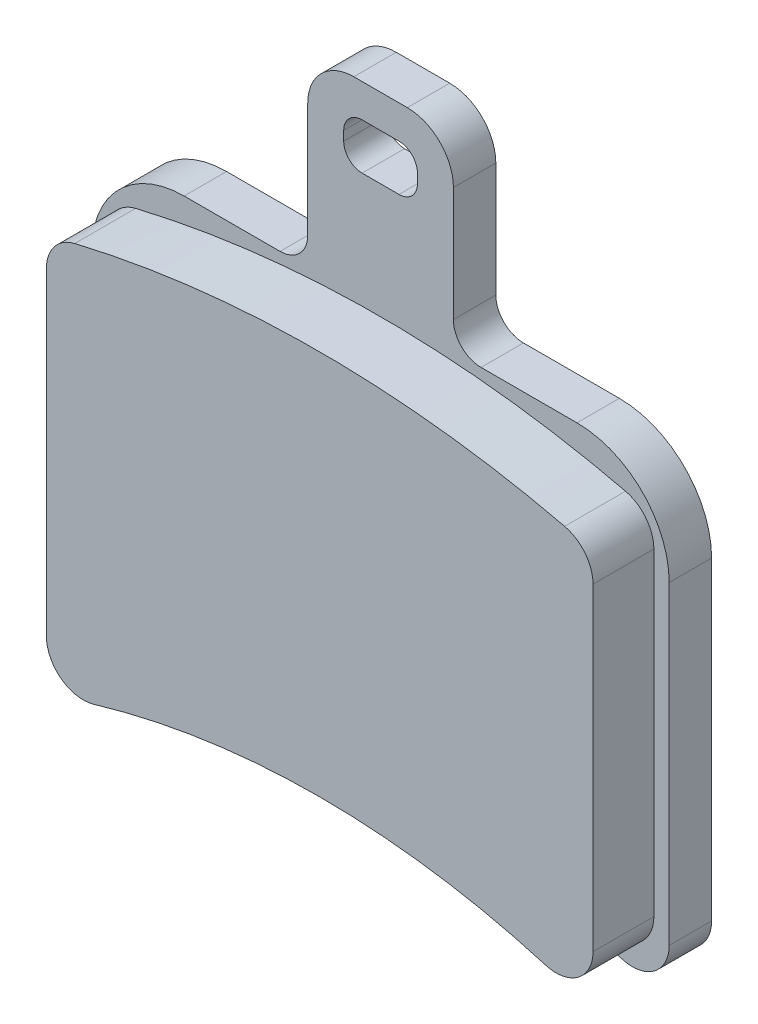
ISO-10303-21;
HEADER;
FILE_DESCRIPTION(('STEP AP214'),'2;1');
FILE_NAME('part.step','',(''),(''),'','','');
FILE_SCHEMA(('AUTOMOTIVE_DESIGN { 1 0 10303 214 1 1 1 1 }'));
ENDSEC;
DATA;
#1=APPLICATION_CONTEXT('core data for automotive mechanical design processes');
#2=APPLICATION_PROTOCOL_DEFINITION('international standard','automotive_design',2000,#1);
#3=PRODUCT_CONTEXT('',#1,'mechanical');
#4=PRODUCT('Part','Part','',(#3));
#5=PRODUCT_RELATED_PRODUCT_CATEGORY('part','',(#4));
#6=PRODUCT_DEFINITION_FORMATION('','',#4);
#7=PRODUCT_DEFINITION_CONTEXT('part definition',#1,'design');
#8=PRODUCT_DEFINITION('design','',#6,#7);
#9=PRODUCT_DEFINITION_SHAPE('','',#8);
#10=(LENGTH_UNIT() NAMED_UNIT(*) SI_UNIT(.MILLI.,.METRE.));
#11=(NAMED_UNIT(*) PLANE_ANGLE_UNIT() SI_UNIT($,.RADIAN.));
#12=(NAMED_UNIT(*) SI_UNIT($,.STERADIAN.) SOLID_ANGLE_UNIT());
#13=UNCERTAINTY_MEASURE_WITH_UNIT(LENGTH_MEASURE(1.E-05),#10,'distance_accuracy_value','');
#14=(GEOMETRIC_REPRESENTATION_CONTEXT(3) GLOBAL_UNCERTAINTY_ASSIGNED_CONTEXT((#13)) GLOBAL_UNIT_ASSIGNED_CONTEXT((#10,
#11,#12)) REPRESENTATION_CONTEXT('',''));
#15=CARTESIAN_POINT('',(0.,0.,0.));
#16=DIRECTION('',(0.,0.,1.));
#17=DIRECTION('',(1.,0.,0.));
#18=AXIS2_PLACEMENT_3D('',#15,#16,#17);
#19=CARTESIAN_POINT('',(16.2814,-4.44620415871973,4.191));
#20=DIRECTION('',(0.,0.,-1.));
#21=DIRECTION('',(-1.,0.,0.));
#22=AXIS2_PLACEMENT_3D('',#19,#20,#21);
#23=CYLINDRICAL_SURFACE('',#22,2.54);
#24=CARTESIAN_POINT('',(16.2814,-4.44620415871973,0.));
#25=DIRECTION('',(0.,0.,1.));
#26=DIRECTION('',(1.,0.,0.));
#27=AXIS2_PLACEMENT_3D('',#24,#25,#26);
#28=CIRCLE('',#27,2.54);
#29=CARTESIAN_POINT('',(18.8214,-4.44620415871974,0.));
#30=VERTEX_POINT('',#29);
#31=CARTESIAN_POINT('',(16.8681171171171,-1.9748962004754,0.));
#32=VERTEX_POINT('',#31);
#33=EDGE_CURVE('E400',#30,#32,#28,.T.);
#34=ORIENTED_EDGE('',*,*,#33,.T.);
#35=DIRECTION('',(0.,0.,-1.));
#36=VECTOR('',#35,1.);
#37=CARTESIAN_POINT('',(16.8681171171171,-1.97489620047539,4.19099999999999));
#38=LINE('',#37,#36);
#39=CARTESIAN_POINT('',(16.8681171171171,-1.97489620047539,4.19099999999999));
#40=VERTEX_POINT('',#39);
#41=EDGE_CURVE('E11',#40,#32,#38,.T.);
#42=ORIENTED_EDGE('',*,*,#41,.F.);
#43=CARTESIAN_POINT('',(16.2814,-4.44620415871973,4.191));
#44=DIRECTION('',(0.,0.,1.));
#45=DIRECTION('',(1.,0.,0.));
#46=AXIS2_PLACEMENT_3D('',#43,#44,#45);
#47=CIRCLE('',#46,2.54);
#48=CARTESIAN_POINT('',(18.8214,-4.44620415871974,4.19099999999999));
#49=VERTEX_POINT('',#48);
#50=EDGE_CURVE('E453',#49,#40,#47,.T.);
#51=ORIENTED_EDGE('',*,*,#50,.F.);
#52=DIRECTION('',(0.,0.,-1.));
#53=VECTOR('',#52,1.);
#54=CARTESIAN_POINT('',(18.8214,-4.44620415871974,4.19099999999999));
#55=LINE('',#54,#53);
#56=EDGE_CURVE('E470',#49,#30,#55,.T.);
#57=ORIENTED_EDGE('',*,*,#56,.T.);
#58=EDGE_LOOP('',(#34,#42,#51,#57));
#59=FACE_BOUND('',#58,.T.);
#60=ADVANCED_FACE('F38',(#59),#23,.T.);
#61=CARTESIAN_POINT('',(0.,-73.025,4.19099999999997));
#62=DIRECTION('',(0.,0.,-1.));
#63=DIRECTION('',(-1.,0.,0.));
#64=AXIS2_PLACEMENT_3D('',#61,#62,#63);
#65=CYLINDRICAL_SURFACE('',#64,73.025);
#66=CARTESIAN_POINT('',(0.,-73.025,0.));
#67=DIRECTION('',(0.,0.,1.));
#68=DIRECTION('',(1.,0.,0.));
#69=AXIS2_PLACEMENT_3D('',#66,#67,#68);
#70=CIRCLE('',#69,73.025);
#71=CARTESIAN_POINT('',(-16.8681171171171,-1.9748962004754,0.));
#72=VERTEX_POINT('',#71);
#73=EDGE_CURVE('E432',#32,#72,#70,.T.);
#74=ORIENTED_EDGE('',*,*,#73,.T.);
#75=DIRECTION('',(0.,0.,-1.));
#76=VECTOR('',#75,1.);
#77=CARTESIAN_POINT('',(-16.8681171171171,-1.97489620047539,4.191));
#78=LINE('',#77,#76);
#79=CARTESIAN_POINT('',(-16.8681171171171,-1.97489620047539,4.191));
#80=VERTEX_POINT('',#79);
#81=EDGE_CURVE('E45',#80,#72,#78,.T.);
#82=ORIENTED_EDGE('',*,*,#81,.F.);
#83=CARTESIAN_POINT('',(0.,-73.025,4.19099999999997));
#84=DIRECTION('',(0.,0.,1.));
#85=DIRECTION('',(1.,0.,0.));
#86=AXIS2_PLACEMENT_3D('',#83,#84,#85);
#87=CIRCLE('',#86,73.025);
#88=EDGE_CURVE('E456',#40,#80,#87,.T.);
#89=ORIENTED_EDGE('',*,*,#88,.F.);
#90=ORIENTED_EDGE('',*,*,#41,.T.);
#91=EDGE_LOOP('',(#74,#82,#89,#90));
#92=FACE_BOUND('',#91,.T.);
#93=ADVANCED_FACE('F494',(#92),#65,.T.);
#94=CARTESIAN_POINT('',(-16.2814,-4.44620415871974,4.19099999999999));
#95=DIRECTION('',(0.,0.,-1.));
#96=DIRECTION('',(-1.,0.,0.));
#97=AXIS2_PLACEMENT_3D('',#94,#95,#96);
#98=CYLINDRICAL_SURFACE('',#97,2.54);
#99=CARTESIAN_POINT('',(-16.2814,-4.44620415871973,0.));
#100=DIRECTION('',(0.,0.,1.));
#101=DIRECTION('',(1.,0.,0.));
#102=AXIS2_PLACEMENT_3D('',#99,#100,#101);
#103=CIRCLE('',#102,2.54);
#104=CARTESIAN_POINT('',(-18.8214,-4.4462041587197,0.));
#105=VERTEX_POINT('',#104);
#106=EDGE_CURVE('E435',#72,#105,#103,.T.);
#107=ORIENTED_EDGE('',*,*,#106,.T.);
#108=DIRECTION('',(0.,0.,-1.));
#109=VECTOR('',#108,1.);
#110=CARTESIAN_POINT('',(-18.8214,-4.44620415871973,4.191));
#111=LINE('',#110,#109);
#112=CARTESIAN_POINT('',(-18.8214,-4.44620415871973,4.191));
#113=VERTEX_POINT('',#112);
#114=EDGE_CURVE('E485',#113,#105,#111,.T.);
#115=ORIENTED_EDGE('',*,*,#114,.F.);
#116=CARTESIAN_POINT('',(-16.2814,-4.44620415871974,4.19099999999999));
#117=DIRECTION('',(0.,0.,1.));
#118=DIRECTION('',(1.,0.,0.));
#119=AXIS2_PLACEMENT_3D('',#116,#117,#118);
#120=CIRCLE('',#119,2.54);
#121=EDGE_CURVE('E458',#80,#113,#120,.T.);
#122=ORIENTED_EDGE('',*,*,#121,.F.);
#123=ORIENTED_EDGE('',*,*,#81,.T.);
#124=EDGE_LOOP('',(#107,#115,#122,#123));
#125=FACE_BOUND('',#124,.T.);
#126=ADVANCED_FACE('F491',(#125),#98,.T.);
#127=CARTESIAN_POINT('',(-18.8214,-4.44620415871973,4.191));
#128=DIRECTION('',(1.,0.,0.));
#129=DIRECTION('',(0.,1.,0.));
#130=AXIS2_PLACEMENT_3D('',#127,#128,#129);
#131=PLANE('',#130);
#132=DIRECTION('',(0.,-1.,0.));
#133=VECTOR('',#132,1.);
#134=CARTESIAN_POINT('',(-18.8214,-4.4462041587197,0.));
#135=LINE('',#134,#133);
#136=CARTESIAN_POINT('',(-18.8214,-26.3652,0.));
#137=VERTEX_POINT('',#136);
#138=EDGE_CURVE('E438',#105,#137,#135,.T.);
#139=ORIENTED_EDGE('',*,*,#138,.T.);
#140=DIRECTION('',(0.,0.,-1.));
#141=VECTOR('',#140,1.);
#142=CARTESIAN_POINT('',(-18.8214,-26.3652,4.19099999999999));
#143=LINE('',#142,#141);
#144=CARTESIAN_POINT('',(-18.8214,-26.3652,4.19099999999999));
#145=VERTEX_POINT('',#144);
#146=EDGE_CURVE('E482',#145,#137,#143,.T.);
#147=ORIENTED_EDGE('',*,*,#146,.F.);
#148=DIRECTION('',(0.,-1.,0.));
#149=VECTOR('',#148,1.);
#150=CARTESIAN_POINT('',(-18.8214,-4.44620415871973,4.191));
#151=LINE('',#150,#149);
#152=EDGE_CURVE('E460',#113,#145,#151,.T.);
#153=ORIENTED_EDGE('',*,*,#152,.F.);
#154=ORIENTED_EDGE('',*,*,#114,.T.);
#155=EDGE_LOOP('',(#139,#147,#153,#154));
#156=FACE_BOUND('',#155,.T.);
#157=ADVANCED_FACE('F500',(#156),#131,.F.);
#158=CARTESIAN_POINT('',(-16.2814,-26.3652,4.191));
#159=DIRECTION('',(0.,0.,-1.));
#160=DIRECTION('',(-1.,0.,0.));
#161=AXIS2_PLACEMENT_3D('',#158,#159,#160);
#162=CYLINDRICAL_SURFACE('',#161,2.54000000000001);
#163=CARTESIAN_POINT('',(-16.2814,-26.3652,0.));
#164=DIRECTION('',(0.,0.,1.));
#165=DIRECTION('',(1.,0.,0.));
#166=AXIS2_PLACEMENT_3D('',#163,#164,#165);
#167=CIRCLE('',#166,2.54000000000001);
#168=CARTESIAN_POINT('',(-15.5595587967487,-28.8004710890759,0.));
#169=VERTEX_POINT('',#168);
#170=EDGE_CURVE('E441',#137,#169,#167,.T.);
#171=ORIENTED_EDGE('',*,*,#170,.T.);
#172=DIRECTION('',(0.,0.,-1.));
#173=VECTOR('',#172,1.);
#174=CARTESIAN_POINT('',(-15.5595587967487,-28.8004710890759,4.19099999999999));
#175=LINE('',#174,#173);
#176=CARTESIAN_POINT('',(-15.5595587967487,-28.8004710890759,4.19099999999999));
#177=VERTEX_POINT('',#176);
#178=EDGE_CURVE('E479',#177,#169,#175,.T.);
#179=ORIENTED_EDGE('',*,*,#178,.F.);
#180=CARTESIAN_POINT('',(-16.2814,-26.3652,4.191));
#181=DIRECTION('',(0.,0.,1.));
#182=DIRECTION('',(1.,0.,0.));
#183=AXIS2_PLACEMENT_3D('',#180,#181,#182);
#184=CIRCLE('',#183,2.54000000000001);
#185=EDGE_CURVE('E462',#145,#177,#184,.T.);
#186=ORIENTED_EDGE('',*,*,#185,.F.);
#187=ORIENTED_EDGE('',*,*,#146,.T.);
#188=EDGE_LOOP('',(#171,#179,#186,#187));
#189=FACE_BOUND('',#188,.T.);
#190=ADVANCED_FACE('F504',(#189),#162,.T.);
#191=CARTESIAN_POINT('',(0.,-81.2936559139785,4.19099999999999));
#192=DIRECTION('',(0.,0.,-1.));
#193=DIRECTION('',(-1.,0.,0.));
#194=AXIS2_PLACEMENT_3D('',#191,#192,#193);
#195=CYLINDRICAL_SURFACE('',#194,54.7506559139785);
#196=CARTESIAN_POINT('',(0.,-81.2936559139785,0.));
#197=DIRECTION('',(0.,0.,-1.));
#198=DIRECTION('',(1.,0.,0.));
#199=AXIS2_PLACEMENT_3D('',#196,#197,#198);
#200=CIRCLE('',#199,54.7506559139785);
#201=CARTESIAN_POINT('',(15.5595587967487,-28.8004710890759,0.));
#202=VERTEX_POINT('',#201);
#203=EDGE_CURVE('E444',#169,#202,#200,.T.);
#204=ORIENTED_EDGE('',*,*,#203,.T.);
#205=DIRECTION('',(0.,0.,-1.));
#206=VECTOR('',#205,1.);
#207=CARTESIAN_POINT('',(15.5595587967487,-28.8004710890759,4.191));
#208=LINE('',#207,#206);
#209=CARTESIAN_POINT('',(15.5595587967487,-28.8004710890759,4.191));
#210=VERTEX_POINT('',#209);
#211=EDGE_CURVE('E476',#210,#202,#208,.T.);
#212=ORIENTED_EDGE('',*,*,#211,.F.);
#213=CARTESIAN_POINT('',(0.,-81.2936559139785,4.19099999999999));
#214=DIRECTION('',(0.,0.,-1.));
#215=DIRECTION('',(1.,0.,0.));
#216=AXIS2_PLACEMENT_3D('',#213,#214,#215);
#217=CIRCLE('',#216,54.7506559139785);
#218=EDGE_CURVE('E464',#177,#210,#217,.T.);
#219=ORIENTED_EDGE('',*,*,#218,.F.);
#220=ORIENTED_EDGE('',*,*,#178,.T.);
#221=EDGE_LOOP('',(#204,#212,#219,#220));
#222=FACE_BOUND('',#221,.T.);
#223=ADVANCED_FACE('F521',(#222),#195,.F.);
#224=CARTESIAN_POINT('',(16.2814,-26.3652,4.19099999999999));
#225=DIRECTION('',(0.,0.,-1.));
#226=DIRECTION('',(-1.,0.,0.));
#227=AXIS2_PLACEMENT_3D('',#224,#225,#226);
#228=CYLINDRICAL_SURFACE('',#227,2.54000000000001);
#229=CARTESIAN_POINT('',(16.2814,-26.3652,0.));
#230=DIRECTION('',(0.,0.,1.));
#231=DIRECTION('',(1.,0.,0.));
#232=AXIS2_PLACEMENT_3D('',#229,#230,#231);
#233=CIRCLE('',#232,2.54000000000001);
#234=CARTESIAN_POINT('',(18.8214,-26.3652,0.));
#235=VERTEX_POINT('',#234);
#236=EDGE_CURVE('E447',#202,#235,#233,.T.);
#237=ORIENTED_EDGE('',*,*,#236,.T.);
#238=DIRECTION('',(0.,0.,-1.));
#239=VECTOR('',#238,1.);
#240=CARTESIAN_POINT('',(18.8214,-26.3652,4.19099999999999));
#241=LINE('',#240,#239);
#242=CARTESIAN_POINT('',(18.8214,-26.3652,4.19099999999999));
#243=VERTEX_POINT('',#242);
#244=EDGE_CURVE('E473',#243,#235,#241,.T.);
#245=ORIENTED_EDGE('',*,*,#244,.F.);
#246=CARTESIAN_POINT('',(16.2814,-26.3652,4.19099999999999));
#247=DIRECTION('',(0.,0.,1.));
#248=DIRECTION('',(1.,0.,0.));
#249=AXIS2_PLACEMENT_3D('',#246,#247,#248);
#250=CIRCLE('',#249,2.54000000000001);
#251=EDGE_CURVE('E466',#210,#243,#250,.T.);
#252=ORIENTED_EDGE('',*,*,#251,.F.);
#253=ORIENTED_EDGE('',*,*,#211,.T.);
#254=EDGE_LOOP('',(#237,#245,#252,#253));
#255=FACE_BOUND('',#254,.T.);
#256=ADVANCED_FACE('F518',(#255),#228,.T.);
#257=CARTESIAN_POINT('',(18.8214,-4.44620415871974,4.19099999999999));
#258=DIRECTION('',(-1.,0.,0.));
#259=DIRECTION('',(0.,-1.,0.));
#260=AXIS2_PLACEMENT_3D('',#257,#258,#259);
#261=PLANE('',#260);
#262=DIRECTION('',(0.,1.,0.));
#263=VECTOR('',#262,1.);
#264=CARTESIAN_POINT('',(18.8214,-4.44620415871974,0.));
#265=LINE('',#264,#263);
#266=EDGE_CURVE('E450',#235,#30,#265,.T.);
#267=ORIENTED_EDGE('',*,*,#266,.T.);
#268=ORIENTED_EDGE('',*,*,#56,.F.);
#269=DIRECTION('',(0.,1.,0.));
#270=VECTOR('',#269,1.);
#271=CARTESIAN_POINT('',(18.8214,-4.44620415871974,4.19099999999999));
#272=LINE('',#271,#270);
#273=EDGE_CURVE('E468',#243,#49,#272,.T.);
#274=ORIENTED_EDGE('',*,*,#273,.F.);
#275=ORIENTED_EDGE('',*,*,#244,.T.);
#276=EDGE_LOOP('',(#267,#268,#274,#275));
#277=FACE_BOUND('',#276,.T.);
#278=ADVANCED_FACE('F515',(#277),#261,.F.);
#279=CARTESIAN_POINT('',(16.2814,-4.44620415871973,4.191));
#280=DIRECTION('',(0.,0.,1.));
#281=DIRECTION('',(1.,0.,0.));
#282=AXIS2_PLACEMENT_3D('',#279,#280,#281);
#283=PLANE('',#282);
#284=ORIENTED_EDGE('',*,*,#50,.T.);
#285=ORIENTED_EDGE('',*,*,#88,.T.);
#286=ORIENTED_EDGE('',*,*,#121,.T.);
#287=ORIENTED_EDGE('',*,*,#152,.T.);
#288=ORIENTED_EDGE('',*,*,#185,.T.);
#289=ORIENTED_EDGE('',*,*,#218,.T.);
#290=ORIENTED_EDGE('',*,*,#251,.T.);
#291=ORIENTED_EDGE('',*,*,#273,.T.);
#292=EDGE_LOOP('',(#284,#285,#286,#287,#288,#289,#290,#291));
#293=FACE_BOUND('',#292,.T.);
#294=ADVANCED_FACE('F508',(#293),#283,.T.);
#295=CARTESIAN_POINT('',(1.8415,10.2108,0.));
#296=DIRECTION('',(0.,0.,-1.));
#297=DIRECTION('',(-1.,0.,0.));
#298=AXIS2_PLACEMENT_3D('',#295,#296,#297);
#299=PLANE('',#298);
#300=DIRECTION('',(0.,1.,0.));
#301=VECTOR('',#300,1.);
#302=CARTESIAN_POINT('',(2.54,9.8298,0.));
#303=LINE('',#302,#301);
#304=CARTESIAN_POINT('',(2.54,9.1948,0.));
#305=VERTEX_POINT('',#304);
#306=CARTESIAN_POINT('',(2.54,9.8298,0.));
#307=VERTEX_POINT('',#306);
#308=EDGE_CURVE('E266',#305,#307,#303,.T.);
#309=ORIENTED_EDGE('',*,*,#308,.F.);
#310=CARTESIAN_POINT('',(1.27,9.1948,0.));
#311=DIRECTION('',(0.,0.,1.));
#312=DIRECTION('',(-1.,0.,0.));
#313=AXIS2_PLACEMENT_3D('',#310,#311,#312);
#314=CIRCLE('',#313,1.27);
#315=CARTESIAN_POINT('',(1.27,7.92480000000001,0.));
#316=VERTEX_POINT('',#315);
#317=EDGE_CURVE('E52',#316,#305,#314,.T.);
#318=ORIENTED_EDGE('',*,*,#317,.F.);
#319=DIRECTION('',(1.,0.,0.));
#320=VECTOR('',#319,1.);
#321=CARTESIAN_POINT('',(1.27,7.92480000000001,0.));
#322=LINE('',#321,#320);
#323=CARTESIAN_POINT('',(-1.27,7.9248,0.));
#324=VERTEX_POINT('',#323);
#325=EDGE_CURVE('E258',#324,#316,#322,.T.);
#326=ORIENTED_EDGE('',*,*,#325,.F.);
#327=CARTESIAN_POINT('',(-1.27,9.1948,0.));
#328=DIRECTION('',(0.,0.,1.));
#329=DIRECTION('',(-1.,0.,0.));
#330=AXIS2_PLACEMENT_3D('',#327,#328,#329);
#331=CIRCLE('',#330,1.27);
#332=CARTESIAN_POINT('',(-2.54,9.1948,0.));
#333=VERTEX_POINT('',#332);
#334=EDGE_CURVE('E285',#333,#324,#331,.T.);
#335=ORIENTED_EDGE('',*,*,#334,.F.);
#336=DIRECTION('',(0.,-1.,0.));
#337=VECTOR('',#336,1.);
#338=CARTESIAN_POINT('',(-2.54,9.1948,0.));
#339=LINE('',#338,#337);
#340=CARTESIAN_POINT('',(-2.54,9.82980000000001,0.));
#341=VERTEX_POINT('',#340);
#342=EDGE_CURVE('E282',#341,#333,#339,.T.);
#343=ORIENTED_EDGE('',*,*,#342,.F.);
#344=CARTESIAN_POINT('',(-1.27,9.8298,0.));
#345=DIRECTION('',(0.,0.,1.));
#346=DIRECTION('',(-1.,0.,0.));
#347=AXIS2_PLACEMENT_3D('',#344,#345,#346);
#348=CIRCLE('',#347,1.27);
#349=CARTESIAN_POINT('',(-1.27,11.0998,0.));
#350=VERTEX_POINT('',#349);
#351=EDGE_CURVE('E279',#350,#341,#348,.T.);
#352=ORIENTED_EDGE('',*,*,#351,.F.);
#353=DIRECTION('',(-1.,0.,0.));
#354=VECTOR('',#353,1.);
#355=CARTESIAN_POINT('',(-1.27,11.0998,0.));
#356=LINE('',#355,#354);
#357=CARTESIAN_POINT('',(1.27,11.0998,0.));
#358=VERTEX_POINT('',#357);
#359=EDGE_CURVE('E276',#358,#350,#356,.T.);
#360=ORIENTED_EDGE('',*,*,#359,.F.);
#361=CARTESIAN_POINT('',(1.27,9.82980000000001,0.));
#362=DIRECTION('',(0.,0.,1.));
#363=DIRECTION('',(-1.,0.,0.));
#364=AXIS2_PLACEMENT_3D('',#361,#362,#363);
#365=CIRCLE('',#364,1.27);
#366=EDGE_CURVE('E273',#307,#358,#365,.T.);
#367=ORIENTED_EDGE('',*,*,#366,.F.);
#368=EDGE_LOOP('',(#309,#318,#326,#335,#343,#352,#360,#367));
#369=FACE_BOUND('',#368,.T.);
#370=CARTESIAN_POINT('',(1.8415,10.2108,0.));
#371=DIRECTION('',(0.,0.,1.));
#372=DIRECTION('',(-1.,0.,0.));
#373=AXIS2_PLACEMENT_3D('',#370,#371,#372);
#374=CIRCLE('',#373,3.175);
#375=CARTESIAN_POINT('',(5.0165,10.2108,0.));
#376=VERTEX_POINT('',#375);
#377=CARTESIAN_POINT('',(1.8415,13.3858,0.));
#378=VERTEX_POINT('',#377);
#379=EDGE_CURVE('E252',#376,#378,#374,.T.);
#380=ORIENTED_EDGE('',*,*,#379,.T.);
#381=DIRECTION('',(-1.,0.,0.));
#382=VECTOR('',#381,1.);
#383=CARTESIAN_POINT('',(-1.8415,13.3858,0.));
#384=LINE('',#383,#382);
#385=CARTESIAN_POINT('',(-1.8415,13.3858,0.));
#386=VERTEX_POINT('',#385);
#387=EDGE_CURVE('E304',#378,#386,#384,.T.);
#388=ORIENTED_EDGE('',*,*,#387,.T.);
#389=CARTESIAN_POINT('',(-1.8415,10.2108,0.));
#390=DIRECTION('',(0.,0.,1.));
#391=DIRECTION('',(-1.,0.,0.));
#392=AXIS2_PLACEMENT_3D('',#389,#390,#391);
#393=CIRCLE('',#392,3.175);
#394=CARTESIAN_POINT('',(-5.0165,10.2108,0.));
#395=VERTEX_POINT('',#394);
#396=EDGE_CURVE('E307',#386,#395,#393,.T.);
#397=ORIENTED_EDGE('',*,*,#396,.T.);
#398=DIRECTION('',(0.,-1.,0.));
#399=VECTOR('',#398,1.);
#400=CARTESIAN_POINT('',(-5.0165,2.33680000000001,0.));
#401=LINE('',#400,#399);
#402=CARTESIAN_POINT('',(-5.0165,2.33680000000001,0.));
#403=VERTEX_POINT('',#402);
#404=EDGE_CURVE('E310',#395,#403,#401,.T.);
#405=ORIENTED_EDGE('',*,*,#404,.T.);
#406=CARTESIAN_POINT('',(-6.9215,2.33680000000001,0.));
#407=DIRECTION('',(0.,0.,-1.));
#408=DIRECTION('',(1.,0.,0.));
#409=AXIS2_PLACEMENT_3D('',#406,#407,#408);
#410=CIRCLE('',#409,1.905);
#411=CARTESIAN_POINT('',(-6.9215,0.43180000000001,0.));
#412=VERTEX_POINT('',#411);
#413=EDGE_CURVE('E313',#403,#412,#410,.T.);
#414=ORIENTED_EDGE('',*,*,#413,.T.);
#415=DIRECTION('',(-1.,0.,0.));
#416=VECTOR('',#415,1.);
#417=CARTESIAN_POINT('',(-13.5255,0.43180000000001,0.));
#418=LINE('',#417,#416);
#419=CARTESIAN_POINT('',(-13.5255,0.43180000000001,0.));
#420=VERTEX_POINT('',#419);
#421=EDGE_CURVE('E316',#412,#420,#418,.T.);
#422=ORIENTED_EDGE('',*,*,#421,.T.);
#423=CARTESIAN_POINT('',(-13.5255,-5.91819999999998,0.));
#424=DIRECTION('',(0.,0.,1.));
#425=DIRECTION('',(-1.,0.,0.));
#426=AXIS2_PLACEMENT_3D('',#423,#424,#425);
#427=CIRCLE('',#426,6.35);
#428=CARTESIAN_POINT('',(-19.8755,-5.9182,0.));
#429=VERTEX_POINT('',#428);
#430=EDGE_CURVE('E319',#420,#429,#427,.T.);
#431=ORIENTED_EDGE('',*,*,#430,.T.);
#432=DIRECTION('',(0.,-1.,0.));
#433=VECTOR('',#432,1.);
#434=CARTESIAN_POINT('',(-19.8755,-5.9182,0.));
#435=LINE('',#434,#433);
#436=CARTESIAN_POINT('',(-19.8755,-27.559,0.));
#437=VERTEX_POINT('',#436);
#438=EDGE_CURVE('E322',#429,#437,#435,.T.);
#439=ORIENTED_EDGE('',*,*,#438,.T.);
#440=CARTESIAN_POINT('',(-17.3355,-27.559,0.));
#441=DIRECTION('',(0.,0.,1.));
#442=DIRECTION('',(1.,0.,0.));
#443=AXIS2_PLACEMENT_3D('',#440,#441,#442);
#444=CIRCLE('',#443,2.54);
#445=CARTESIAN_POINT('',(-16.5978191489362,-29.9895198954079,0.));
#446=VERTEX_POINT('',#445);
#447=EDGE_CURVE('E325',#437,#446,#444,.T.);
#448=ORIENTED_EDGE('',*,*,#447,.T.);
#449=CARTESIAN_POINT('',(0.,-84.6762175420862,0.));
#450=DIRECTION('',(0.,0.,-1.));
#451=DIRECTION('',(1.,0.,0.));
#452=AXIS2_PLACEMENT_3D('',#449,#450,#451);
#453=CIRCLE('',#452,57.15);
#454=CARTESIAN_POINT('',(16.5978191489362,-29.9895198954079,0.));
#455=VERTEX_POINT('',#454);
#456=EDGE_CURVE('E328',#446,#455,#453,.T.);
#457=ORIENTED_EDGE('',*,*,#456,.T.);
#458=CARTESIAN_POINT('',(17.3355,-27.559,0.));
#459=DIRECTION('',(0.,0.,1.));
#460=DIRECTION('',(1.,0.,0.));
#461=AXIS2_PLACEMENT_3D('',#458,#459,#460);
#462=CIRCLE('',#461,2.54);
#463=CARTESIAN_POINT('',(19.8755,-27.559,0.));
#464=VERTEX_POINT('',#463);
#465=EDGE_CURVE('E331',#455,#464,#462,.T.);
#466=ORIENTED_EDGE('',*,*,#465,.T.);
#467=DIRECTION('',(0.,1.,0.));
#468=VECTOR('',#467,1.);
#469=CARTESIAN_POINT('',(19.8755,-5.9182,0.));
#470=LINE('',#469,#468);
#471=CARTESIAN_POINT('',(19.8755,-5.9182,0.));
#472=VERTEX_POINT('',#471);
#473=EDGE_CURVE('E334',#464,#472,#470,.T.);
#474=ORIENTED_EDGE('',*,*,#473,.T.);
#475=CARTESIAN_POINT('',(13.5255,-5.9182,0.));
#476=DIRECTION('',(0.,0.,1.));
#477=DIRECTION('',(1.,0.,0.));
#478=AXIS2_PLACEMENT_3D('',#475,#476,#477);
#479=CIRCLE('',#478,6.35);
#480=CARTESIAN_POINT('',(13.5255,0.431799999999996,0.));
#481=VERTEX_POINT('',#480);
#482=EDGE_CURVE('E337',#472,#481,#479,.T.);
#483=ORIENTED_EDGE('',*,*,#482,.T.);
#484=DIRECTION('',(-1.,0.,0.));
#485=VECTOR('',#484,1.);
#486=CARTESIAN_POINT('',(6.9215,0.431799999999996,0.));
#487=LINE('',#486,#485);
#488=CARTESIAN_POINT('',(6.9215,0.431799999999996,0.));
#489=VERTEX_POINT('',#488);
#490=EDGE_CURVE('E340',#481,#489,#487,.T.);
#491=ORIENTED_EDGE('',*,*,#490,.T.);
#492=CARTESIAN_POINT('',(6.9215,2.3368,0.));
#493=DIRECTION('',(0.,0.,-1.));
#494=DIRECTION('',(-1.,0.,0.));
#495=AXIS2_PLACEMENT_3D('',#492,#493,#494);
#496=CIRCLE('',#495,1.905);
#497=CARTESIAN_POINT('',(5.0165,2.33680000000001,0.));
#498=VERTEX_POINT('',#497);
#499=EDGE_CURVE('E343',#489,#498,#496,.T.);
#500=ORIENTED_EDGE('',*,*,#499,.T.);
#501=DIRECTION('',(0.,1.,0.));
#502=VECTOR('',#501,1.);
#503=CARTESIAN_POINT('',(5.0165,10.2108,0.));
#504=LINE('',#503,#502);
#505=EDGE_CURVE('E346',#498,#376,#504,.T.);
#506=ORIENTED_EDGE('',*,*,#505,.T.);
#507=EDGE_LOOP('',(#380,#388,#397,#405,#414,#422,#431,#439,#448,#457,#466,#474,#483,#491,#500,#506));
#508=FACE_BOUND('',#507,.T.);
#509=ORIENTED_EDGE('',*,*,#73,.F.);
#510=ORIENTED_EDGE('',*,*,#33,.F.);
#511=ORIENTED_EDGE('',*,*,#266,.F.);
#512=ORIENTED_EDGE('',*,*,#236,.F.);
#513=ORIENTED_EDGE('',*,*,#203,.F.);
#514=ORIENTED_EDGE('',*,*,#170,.F.);
#515=ORIENTED_EDGE('',*,*,#138,.F.);
#516=ORIENTED_EDGE('',*,*,#106,.F.);
#517=EDGE_LOOP('',(#509,#510,#511,#512,#513,#514,#515,#516));
#518=FACE_BOUND('',#517,.T.);
#519=ADVANCED_FACE('F497',(#369,#508,#518),#299,.F.);
#520=CARTESIAN_POINT('',(1.8415,10.2108,-2.92100000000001));
#521=DIRECTION('',(0.,0.,1.));
#522=DIRECTION('',(1.,0.,0.));
#523=AXIS2_PLACEMENT_3D('',#520,#521,#522);
#524=CYLINDRICAL_SURFACE('',#523,3.175);
#525=ORIENTED_EDGE('',*,*,#379,.F.);
#526=DIRECTION('',(0.,0.,1.));
#527=VECTOR('',#526,1.);
#528=CARTESIAN_POINT('',(5.0165,10.2108,-2.92100000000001));
#529=LINE('',#528,#527);
#530=CARTESIAN_POINT('',(5.0165,10.2108,-2.92100000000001));
#531=VERTEX_POINT('',#530);
#532=EDGE_CURVE('E398',#531,#376,#529,.T.);
#533=ORIENTED_EDGE('',*,*,#532,.F.);
#534=CARTESIAN_POINT('',(1.8415,10.2108,-2.92100000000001));
#535=DIRECTION('',(0.,0.,1.));
#536=DIRECTION('',(-1.,0.,0.));
#537=AXIS2_PLACEMENT_3D('',#534,#535,#536);
#538=CIRCLE('',#537,3.175);
#539=CARTESIAN_POINT('',(1.8415,13.3858,-2.92100000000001));
#540=VERTEX_POINT('',#539);
#541=EDGE_CURVE('E349',#531,#540,#538,.T.);
#542=ORIENTED_EDGE('',*,*,#541,.T.);
#543=DIRECTION('',(0.,0.,1.));
#544=VECTOR('',#543,1.);
#545=CARTESIAN_POINT('',(1.8415,13.3858,-2.92100000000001));
#546=LINE('',#545,#544);
#547=EDGE_CURVE('E397',#540,#378,#546,.T.);
#548=ORIENTED_EDGE('',*,*,#547,.T.);
#549=EDGE_LOOP('',(#525,#533,#542,#548));
#550=FACE_BOUND('',#549,.T.);
#551=ADVANCED_FACE('F658',(#550),#524,.T.);
#552=CARTESIAN_POINT('',(5.0165,10.2108,-2.92100000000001));
#553=DIRECTION('',(1.,0.,0.));
#554=DIRECTION('',(0.,1.,0.));
#555=AXIS2_PLACEMENT_3D('',#552,#553,#554);
#556=PLANE('',#555);
#557=ORIENTED_EDGE('',*,*,#505,.F.);
#558=DIRECTION('',(0.,0.,1.));
#559=VECTOR('',#558,1.);
#560=CARTESIAN_POINT('',(5.0165,2.33680000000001,-2.92100000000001));
#561=LINE('',#560,#559);
#562=CARTESIAN_POINT('',(5.0165,2.33680000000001,-2.92100000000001));
#563=VERTEX_POINT('',#562);
#564=EDGE_CURVE('E401',#563,#498,#561,.T.);
#565=ORIENTED_EDGE('',*,*,#564,.F.);
#566=DIRECTION('',(0.,1.,0.));
#567=VECTOR('',#566,1.);
#568=CARTESIAN_POINT('',(5.0165,10.2108,-2.92100000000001));
#569=LINE('',#568,#567);
#570=EDGE_CURVE('E394',#563,#531,#569,.T.);
#571=ORIENTED_EDGE('',*,*,#570,.T.);
#572=ORIENTED_EDGE('',*,*,#532,.T.);
#573=EDGE_LOOP('',(#557,#565,#571,#572));
#574=FACE_BOUND('',#573,.T.);
#575=ADVANCED_FACE('F650',(#574),#556,.T.);
#576=CARTESIAN_POINT('',(6.9215,2.3368,-2.92100000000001));
#577=DIRECTION('',(0.,0.,1.));
#578=DIRECTION('',(1.,0.,0.));
#579=AXIS2_PLACEMENT_3D('',#576,#577,#578);
#580=CYLINDRICAL_SURFACE('',#579,1.905);
#581=ORIENTED_EDGE('',*,*,#499,.F.);
#582=DIRECTION('',(0.,0.,1.));
#583=VECTOR('',#582,1.);
#584=CARTESIAN_POINT('',(6.92150000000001,0.431799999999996,-2.92099999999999));
#585=LINE('',#584,#583);
#586=CARTESIAN_POINT('',(6.92150000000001,0.431799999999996,-2.92099999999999));
#587=VERTEX_POINT('',#586);
#588=EDGE_CURVE('E403',#587,#489,#585,.T.);
#589=ORIENTED_EDGE('',*,*,#588,.F.);
#590=CARTESIAN_POINT('',(6.9215,2.3368,-2.92100000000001));
#591=DIRECTION('',(0.,0.,-1.));
#592=DIRECTION('',(-1.,0.,0.));
#593=AXIS2_PLACEMENT_3D('',#590,#591,#592);
#594=CIRCLE('',#593,1.905);
#595=EDGE_CURVE('E391',#587,#563,#594,.T.);
#596=ORIENTED_EDGE('',*,*,#595,.T.);
#597=ORIENTED_EDGE('',*,*,#564,.T.);
#598=EDGE_LOOP('',(#581,#589,#596,#597));
#599=FACE_BOUND('',#598,.T.);
#600=ADVANCED_FACE('F642',(#599),#580,.F.);
#601=CARTESIAN_POINT('',(6.92150000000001,0.431799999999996,-2.92099999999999));
#602=DIRECTION('',(0.,1.,0.));
#603=DIRECTION('',(-1.,0.,0.));
#604=AXIS2_PLACEMENT_3D('',#601,#602,#603);
#605=PLANE('',#604);
#606=ORIENTED_EDGE('',*,*,#490,.F.);
#607=DIRECTION('',(0.,0.,1.));
#608=VECTOR('',#607,1.);
#609=CARTESIAN_POINT('',(13.5255,0.431799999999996,-2.92100000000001));
#610=LINE('',#609,#608);
#611=CARTESIAN_POINT('',(13.5255,0.431799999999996,-2.92100000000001));
#612=VERTEX_POINT('',#611);
#613=EDGE_CURVE('E405',#612,#481,#610,.T.);
#614=ORIENTED_EDGE('',*,*,#613,.F.);
#615=DIRECTION('',(-1.,0.,0.));
#616=VECTOR('',#615,1.);
#617=CARTESIAN_POINT('',(6.92150000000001,0.431799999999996,-2.92099999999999));
#618=LINE('',#617,#616);
#619=EDGE_CURVE('E388',#612,#587,#618,.T.);
#620=ORIENTED_EDGE('',*,*,#619,.T.);
#621=ORIENTED_EDGE('',*,*,#588,.T.);
#622=EDGE_LOOP('',(#606,#614,#620,#621));
#623=FACE_BOUND('',#622,.T.);
#624=ADVANCED_FACE('F633',(#623),#605,.T.);
#625=CARTESIAN_POINT('',(13.5255,-5.9182,-2.92099999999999));
#626=DIRECTION('',(0.,0.,1.));
#627=DIRECTION('',(1.,0.,0.));
#628=AXIS2_PLACEMENT_3D('',#625,#626,#627);
#629=CYLINDRICAL_SURFACE('',#628,6.35);
#630=ORIENTED_EDGE('',*,*,#482,.F.);
#631=DIRECTION('',(0.,0.,1.));
#632=VECTOR('',#631,1.);
#633=CARTESIAN_POINT('',(19.8755,-5.91820000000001,-2.92100000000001));
#634=LINE('',#633,#632);
#635=CARTESIAN_POINT('',(19.8755,-5.91820000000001,-2.92100000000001));
#636=VERTEX_POINT('',#635);
#637=EDGE_CURVE('E407',#636,#472,#634,.T.);
#638=ORIENTED_EDGE('',*,*,#637,.F.);
#639=CARTESIAN_POINT('',(13.5255,-5.9182,-2.92099999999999));
#640=DIRECTION('',(0.,0.,1.));
#641=DIRECTION('',(1.,0.,0.));
#642=AXIS2_PLACEMENT_3D('',#639,#640,#641);
#643=CIRCLE('',#642,6.35);
#644=EDGE_CURVE('E385',#636,#612,#643,.T.);
#645=ORIENTED_EDGE('',*,*,#644,.T.);
#646=ORIENTED_EDGE('',*,*,#613,.T.);
#647=EDGE_LOOP('',(#630,#638,#645,#646));
#648=FACE_BOUND('',#647,.T.);
#649=ADVANCED_FACE('F624',(#648),#629,.T.);
#650=CARTESIAN_POINT('',(19.8755,-5.91820000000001,-2.92100000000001));
#651=DIRECTION('',(1.,0.,0.));
#652=DIRECTION('',(0.,0.,-1.));
#653=AXIS2_PLACEMENT_3D('',#650,#651,#652);
#654=PLANE('',#653);
#655=ORIENTED_EDGE('',*,*,#473,.F.);
#656=DIRECTION('',(0.,0.,1.));
#657=VECTOR('',#656,1.);
#658=CARTESIAN_POINT('',(19.8755,-27.559,-2.92099999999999));
#659=LINE('',#658,#657);
#660=CARTESIAN_POINT('',(19.8755,-27.559,-2.92099999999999));
#661=VERTEX_POINT('',#660);
#662=EDGE_CURVE('E409',#661,#464,#659,.T.);
#663=ORIENTED_EDGE('',*,*,#662,.F.);
#664=DIRECTION('',(0.,1.,0.));
#665=VECTOR('',#664,1.);
#666=CARTESIAN_POINT('',(19.8755,-5.91820000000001,-2.92100000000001));
#667=LINE('',#666,#665);
#668=EDGE_CURVE('E382',#661,#636,#667,.T.);
#669=ORIENTED_EDGE('',*,*,#668,.T.);
#670=ORIENTED_EDGE('',*,*,#637,.T.);
#671=EDGE_LOOP('',(#655,#663,#669,#670));
#672=FACE_BOUND('',#671,.T.);
#673=ADVANCED_FACE('F616',(#672),#654,.T.);
#674=CARTESIAN_POINT('',(17.3355,-27.559,-2.92100000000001));
#675=DIRECTION('',(0.,0.,1.));
#676=DIRECTION('',(1.,0.,0.));
#677=AXIS2_PLACEMENT_3D('',#674,#675,#676);
#678=CYLINDRICAL_SURFACE('',#677,2.54);
#679=ORIENTED_EDGE('',*,*,#465,.F.);
#680=DIRECTION('',(0.,0.,1.));
#681=VECTOR('',#680,1.);
#682=CARTESIAN_POINT('',(16.5978191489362,-29.9895198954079,-2.92099999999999));
#683=LINE('',#682,#681);
#684=CARTESIAN_POINT('',(16.5978191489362,-29.9895198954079,-2.92099999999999));
#685=VERTEX_POINT('',#684);
#686=EDGE_CURVE('E411',#685,#455,#683,.T.);
#687=ORIENTED_EDGE('',*,*,#686,.F.);
#688=CARTESIAN_POINT('',(17.3355,-27.559,-2.92100000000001));
#689=DIRECTION('',(0.,0.,1.));
#690=DIRECTION('',(1.,0.,0.));
#691=AXIS2_PLACEMENT_3D('',#688,#689,#690);
#692=CIRCLE('',#691,2.54);
#693=EDGE_CURVE('E379',#685,#661,#692,.T.);
#694=ORIENTED_EDGE('',*,*,#693,.T.);
#695=ORIENTED_EDGE('',*,*,#662,.T.);
#696=EDGE_LOOP('',(#679,#687,#694,#695));
#697=FACE_BOUND('',#696,.T.);
#698=ADVANCED_FACE('F605',(#697),#678,.T.);
#699=CARTESIAN_POINT('',(0.,-84.6762175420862,-2.92099999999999));
#700=DIRECTION('',(0.,0.,1.));
#701=DIRECTION('',(1.,0.,0.));
#702=AXIS2_PLACEMENT_3D('',#699,#700,#701);
#703=CYLINDRICAL_SURFACE('',#702,57.15);
#704=ORIENTED_EDGE('',*,*,#456,.F.);
#705=DIRECTION('',(0.,0.,1.));
#706=VECTOR('',#705,1.);
#707=CARTESIAN_POINT('',(-16.5978191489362,-29.9895198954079,-2.92100000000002));
#708=LINE('',#707,#706);
#709=CARTESIAN_POINT('',(-16.5978191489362,-29.9895198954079,-2.92100000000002));
#710=VERTEX_POINT('',#709);
#711=EDGE_CURVE('E413',#710,#446,#708,.T.);
#712=ORIENTED_EDGE('',*,*,#711,.F.);
#713=CARTESIAN_POINT('',(0.,-84.6762175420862,-2.92099999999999));
#714=DIRECTION('',(0.,0.,-1.));
#715=DIRECTION('',(1.,0.,0.));
#716=AXIS2_PLACEMENT_3D('',#713,#714,#715);
#717=CIRCLE('',#716,57.15);
#718=EDGE_CURVE('E376',#710,#685,#717,.T.);
#719=ORIENTED_EDGE('',*,*,#718,.T.);
#720=ORIENTED_EDGE('',*,*,#686,.T.);
#721=EDGE_LOOP('',(#704,#712,#719,#720));
#722=FACE_BOUND('',#721,.T.);
#723=ADVANCED_FACE('F588',(#722),#703,.F.);
#724=CARTESIAN_POINT('',(-17.3355,-27.559,-2.92100000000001));
#725=DIRECTION('',(0.,0.,1.));
#726=DIRECTION('',(1.,0.,0.));
#727=AXIS2_PLACEMENT_3D('',#724,#725,#726);
#728=CYLINDRICAL_SURFACE('',#727,2.54);
#729=ORIENTED_EDGE('',*,*,#447,.F.);
#730=DIRECTION('',(0.,0.,1.));
#731=VECTOR('',#730,1.);
#732=CARTESIAN_POINT('',(-19.8755,-27.559,-2.92100000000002));
#733=LINE('',#732,#731);
#734=CARTESIAN_POINT('',(-19.8755,-27.559,-2.92100000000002));
#735=VERTEX_POINT('',#734);
#736=EDGE_CURVE('E415',#735,#437,#733,.T.);
#737=ORIENTED_EDGE('',*,*,#736,.F.);
#738=CARTESIAN_POINT('',(-17.3355,-27.559,-2.92100000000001));
#739=DIRECTION('',(0.,0.,1.));
#740=DIRECTION('',(1.,0.,0.));
#741=AXIS2_PLACEMENT_3D('',#738,#739,#740);
#742=CIRCLE('',#741,2.54);
#743=EDGE_CURVE('E373',#735,#710,#742,.T.);
#744=ORIENTED_EDGE('',*,*,#743,.T.);
#745=ORIENTED_EDGE('',*,*,#711,.T.);
#746=EDGE_LOOP('',(#729,#737,#744,#745));
#747=FACE_BOUND('',#746,.T.);
#748=ADVANCED_FACE('F569',(#747),#728,.T.);
#749=CARTESIAN_POINT('',(-19.8755,-5.91819999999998,-2.92100000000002));
#750=DIRECTION('',(-1.,0.,0.));
#751=DIRECTION('',(0.,-1.,0.));
#752=AXIS2_PLACEMENT_3D('',#749,#750,#751);
#753=PLANE('',#752);
#754=ORIENTED_EDGE('',*,*,#438,.F.);
#755=DIRECTION('',(0.,0.,1.));
#756=VECTOR('',#755,1.);
#757=CARTESIAN_POINT('',(-19.8755,-5.91819999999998,-2.92100000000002));
#758=LINE('',#757,#756);
#759=CARTESIAN_POINT('',(-19.8755,-5.91819999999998,-2.92100000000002));
#760=VERTEX_POINT('',#759);
#761=EDGE_CURVE('E417',#760,#429,#758,.T.);
#762=ORIENTED_EDGE('',*,*,#761,.F.);
#763=DIRECTION('',(0.,-1.,0.));
#764=VECTOR('',#763,1.);
#765=CARTESIAN_POINT('',(-19.8755,-5.91819999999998,-2.92100000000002));
#766=LINE('',#765,#764);
#767=EDGE_CURVE('E370',#760,#735,#766,.T.);
#768=ORIENTED_EDGE('',*,*,#767,.T.);
#769=ORIENTED_EDGE('',*,*,#736,.T.);
#770=EDGE_LOOP('',(#754,#762,#768,#769));
#771=FACE_BOUND('',#770,.T.);
#772=ADVANCED_FACE('F563',(#771),#753,.T.);
#773=CARTESIAN_POINT('',(-13.5255,-5.91819999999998,-2.92100000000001));
#774=DIRECTION('',(0.,0.,1.));
#775=DIRECTION('',(1.,0.,0.));
#776=AXIS2_PLACEMENT_3D('',#773,#774,#775);
#777=CYLINDRICAL_SURFACE('',#776,6.35);
#778=ORIENTED_EDGE('',*,*,#430,.F.);
#779=DIRECTION('',(0.,0.,1.));
#780=VECTOR('',#779,1.);
#781=CARTESIAN_POINT('',(-13.5255,0.43180000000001,-2.92099999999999));
#782=LINE('',#781,#780);
#783=CARTESIAN_POINT('',(-13.5255,0.43180000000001,-2.92099999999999));
#784=VERTEX_POINT('',#783);
#785=EDGE_CURVE('E419',#784,#420,#782,.T.);
#786=ORIENTED_EDGE('',*,*,#785,.F.);
#787=CARTESIAN_POINT('',(-13.5255,-5.91819999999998,-2.92100000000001));
#788=DIRECTION('',(0.,0.,1.));
#789=DIRECTION('',(-1.,0.,0.));
#790=AXIS2_PLACEMENT_3D('',#787,#788,#789);
#791=CIRCLE('',#790,6.35);
#792=EDGE_CURVE('E367',#784,#760,#791,.T.);
#793=ORIENTED_EDGE('',*,*,#792,.T.);
#794=ORIENTED_EDGE('',*,*,#761,.T.);
#795=EDGE_LOOP('',(#778,#786,#793,#794));
#796=FACE_BOUND('',#795,.T.);
#797=ADVANCED_FACE('F568',(#796),#777,.T.);
#798=CARTESIAN_POINT('',(-13.5255,0.43180000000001,-2.92099999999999));
#799=DIRECTION('',(0.,1.,0.));
#800=DIRECTION('',(-1.,0.,0.));
#801=AXIS2_PLACEMENT_3D('',#798,#799,#800);
#802=PLANE('',#801);
#803=ORIENTED_EDGE('',*,*,#421,.F.);
#804=DIRECTION('',(0.,0.,1.));
#805=VECTOR('',#804,1.);
#806=CARTESIAN_POINT('',(-6.9215,0.43180000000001,-2.92100000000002));
#807=LINE('',#806,#805);
#808=CARTESIAN_POINT('',(-6.9215,0.43180000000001,-2.92100000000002));
#809=VERTEX_POINT('',#808);
#810=EDGE_CURVE('E421',#809,#412,#807,.T.);
#811=ORIENTED_EDGE('',*,*,#810,.F.);
#812=DIRECTION('',(-1.,0.,0.));
#813=VECTOR('',#812,1.);
#814=CARTESIAN_POINT('',(-13.5255,0.43180000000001,-2.92099999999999));
#815=LINE('',#814,#813);
#816=EDGE_CURVE('E364',#809,#784,#815,.T.);
#817=ORIENTED_EDGE('',*,*,#816,.T.);
#818=ORIENTED_EDGE('',*,*,#785,.T.);
#819=EDGE_LOOP('',(#803,#811,#817,#818));
#820=FACE_BOUND('',#819,.T.);
#821=ADVANCED_FACE('F554',(#820),#802,.T.);
#822=CARTESIAN_POINT('',(-6.9215,2.33680000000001,-2.92100000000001));
#823=DIRECTION('',(0.,0.,1.));
#824=DIRECTION('',(1.,0.,0.));
#825=AXIS2_PLACEMENT_3D('',#822,#823,#824);
#826=CYLINDRICAL_SURFACE('',#825,1.905);
#827=ORIENTED_EDGE('',*,*,#413,.F.);
#828=DIRECTION('',(0.,0.,1.));
#829=VECTOR('',#828,1.);
#830=CARTESIAN_POINT('',(-5.0165,2.3368,-2.92100000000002));
#831=LINE('',#830,#829);
#832=CARTESIAN_POINT('',(-5.0165,2.3368,-2.92100000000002));
#833=VERTEX_POINT('',#832);
#834=EDGE_CURVE('E423',#833,#403,#831,.T.);
#835=ORIENTED_EDGE('',*,*,#834,.F.);
#836=CARTESIAN_POINT('',(-6.9215,2.33680000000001,-2.92100000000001));
#837=DIRECTION('',(0.,0.,-1.));
#838=DIRECTION('',(1.,0.,0.));
#839=AXIS2_PLACEMENT_3D('',#836,#837,#838);
#840=CIRCLE('',#839,1.905);
#841=EDGE_CURVE('E361',#833,#809,#840,.T.);
#842=ORIENTED_EDGE('',*,*,#841,.T.);
#843=ORIENTED_EDGE('',*,*,#810,.T.);
#844=EDGE_LOOP('',(#827,#835,#842,#843));
#845=FACE_BOUND('',#844,.T.);
#846=ADVANCED_FACE('F733',(#845),#826,.F.);
#847=CARTESIAN_POINT('',(-5.0165,2.3368,-2.92100000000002));
#848=DIRECTION('',(-1.,0.,0.));
#849=DIRECTION('',(0.,-1.,0.));
#850=AXIS2_PLACEMENT_3D('',#847,#848,#849);
#851=PLANE('',#850);
#852=ORIENTED_EDGE('',*,*,#404,.F.);
#853=DIRECTION('',(0.,0.,1.));
#854=VECTOR('',#853,1.);
#855=CARTESIAN_POINT('',(-5.0165,10.2108,-2.92100000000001));
#856=LINE('',#855,#854);
#857=CARTESIAN_POINT('',(-5.0165,10.2108,-2.92100000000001));
#858=VERTEX_POINT('',#857);
#859=EDGE_CURVE('E425',#858,#395,#856,.T.);
#860=ORIENTED_EDGE('',*,*,#859,.F.);
#861=DIRECTION('',(0.,-1.,0.));
#862=VECTOR('',#861,1.);
#863=CARTESIAN_POINT('',(-5.0165,2.3368,-2.92100000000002));
#864=LINE('',#863,#862);
#865=EDGE_CURVE('E358',#858,#833,#864,.T.);
#866=ORIENTED_EDGE('',*,*,#865,.T.);
#867=ORIENTED_EDGE('',*,*,#834,.T.);
#868=EDGE_LOOP('',(#852,#860,#866,#867));
#869=FACE_BOUND('',#868,.T.);
#870=ADVANCED_FACE('F742',(#869),#851,.T.);
#871=CARTESIAN_POINT('',(-1.8415,10.2108,-2.92100000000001));
#872=DIRECTION('',(0.,0.,1.));
#873=DIRECTION('',(1.,0.,0.));
#874=AXIS2_PLACEMENT_3D('',#871,#872,#873);
#875=CYLINDRICAL_SURFACE('',#874,3.175);
#876=ORIENTED_EDGE('',*,*,#396,.F.);
#877=DIRECTION('',(0.,0.,1.));
#878=VECTOR('',#877,1.);
#879=CARTESIAN_POINT('',(-1.8415,13.3858,-2.92099999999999));
#880=LINE('',#879,#878);
#881=CARTESIAN_POINT('',(-1.8415,13.3858,-2.92099999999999));
#882=VERTEX_POINT('',#881);
#883=EDGE_CURVE('E427',#882,#386,#880,.T.);
#884=ORIENTED_EDGE('',*,*,#883,.F.);
#885=CARTESIAN_POINT('',(-1.8415,10.2108,-2.92100000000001));
#886=DIRECTION('',(0.,0.,1.));
#887=DIRECTION('',(-1.,0.,0.));
#888=AXIS2_PLACEMENT_3D('',#885,#886,#887);
#889=CIRCLE('',#888,3.175);
#890=EDGE_CURVE('E355',#882,#858,#889,.T.);
#891=ORIENTED_EDGE('',*,*,#890,.T.);
#892=ORIENTED_EDGE('',*,*,#859,.T.);
#893=EDGE_LOOP('',(#876,#884,#891,#892));
#894=FACE_BOUND('',#893,.T.);
#895=ADVANCED_FACE('F752',(#894),#875,.T.);
#896=CARTESIAN_POINT('',(-1.8415,13.3858,-2.92099999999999));
#897=DIRECTION('',(0.,1.,0.));
#898=DIRECTION('',(0.,0.,1.));
#899=AXIS2_PLACEMENT_3D('',#896,#897,#898);
#900=PLANE('',#899);
#901=ORIENTED_EDGE('',*,*,#387,.F.);
#902=ORIENTED_EDGE('',*,*,#547,.F.);
#903=DIRECTION('',(-1.,0.,0.));
#904=VECTOR('',#903,1.);
#905=CARTESIAN_POINT('',(-1.8415,13.3858,-2.92099999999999));
#906=LINE('',#905,#904);
#907=EDGE_CURVE('E352',#540,#882,#906,.T.);
#908=ORIENTED_EDGE('',*,*,#907,.T.);
#909=ORIENTED_EDGE('',*,*,#883,.T.);
#910=EDGE_LOOP('',(#901,#902,#908,#909));
#911=FACE_BOUND('',#910,.T.);
#912=ADVANCED_FACE('F762',(#911),#900,.T.);
#913=CARTESIAN_POINT('',(1.8415,10.2108,-2.92100000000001));
#914=DIRECTION('',(0.,0.,-1.));
#915=DIRECTION('',(-1.,0.,0.));
#916=AXIS2_PLACEMENT_3D('',#913,#914,#915);
#917=PLANE('',#916);
#918=CARTESIAN_POINT('',(1.27,9.1948,-2.92100000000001));
#919=DIRECTION('',(0.,0.,-1.));
#920=DIRECTION('',(-1.,0.,0.));
#921=AXIS2_PLACEMENT_3D('',#918,#919,#920);
#922=CIRCLE('',#921,1.27);
#923=CARTESIAN_POINT('',(1.27,7.92480000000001,-2.92100000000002));
#924=VERTEX_POINT('',#923);
#925=CARTESIAN_POINT('',(2.54,9.1948,-2.92099999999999));
#926=VERTEX_POINT('',#925);
#927=EDGE_CURVE('E256',#924,#926,#922,.F.);
#928=ORIENTED_EDGE('',*,*,#927,.T.);
#929=DIRECTION('',(0.,1.,0.));
#930=VECTOR('',#929,1.);
#931=CARTESIAN_POINT('',(2.54,9.82980000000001,-2.92099999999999));
#932=LINE('',#931,#930);
#933=CARTESIAN_POINT('',(2.54,9.82980000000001,-2.92099999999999));
#934=VERTEX_POINT('',#933);
#935=EDGE_CURVE('E245',#926,#934,#932,.T.);
#936=ORIENTED_EDGE('',*,*,#935,.T.);
#937=CARTESIAN_POINT('',(1.27,9.82980000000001,-2.92100000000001));
#938=DIRECTION('',(0.,0.,-1.));
#939=DIRECTION('',(-1.,0.,0.));
#940=AXIS2_PLACEMENT_3D('',#937,#938,#939);
#941=CIRCLE('',#940,1.27);
#942=CARTESIAN_POINT('',(1.27,11.0998,-2.92099999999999));
#943=VERTEX_POINT('',#942);
#944=EDGE_CURVE('E902',#934,#943,#941,.F.);
#945=ORIENTED_EDGE('',*,*,#944,.T.);
#946=DIRECTION('',(-1.,0.,0.));
#947=VECTOR('',#946,1.);
#948=CARTESIAN_POINT('',(-1.27,11.0998,-2.92100000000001));
#949=LINE('',#948,#947);
#950=CARTESIAN_POINT('',(-1.27,11.0998,-2.92100000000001));
#951=VERTEX_POINT('',#950);
#952=EDGE_CURVE('E908',#943,#951,#949,.T.);
#953=ORIENTED_EDGE('',*,*,#952,.T.);
#954=CARTESIAN_POINT('',(-1.27,9.8298,-2.92099999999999));
#955=DIRECTION('',(0.,0.,-1.));
#956=DIRECTION('',(-1.,0.,0.));
#957=AXIS2_PLACEMENT_3D('',#954,#955,#956);
#958=CIRCLE('',#957,1.27);
#959=CARTESIAN_POINT('',(-2.54,9.82980000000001,-2.92100000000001));
#960=VERTEX_POINT('',#959);
#961=EDGE_CURVE('E911',#951,#960,#958,.F.);
#962=ORIENTED_EDGE('',*,*,#961,.T.);
#963=DIRECTION('',(0.,-1.,0.));
#964=VECTOR('',#963,1.);
#965=CARTESIAN_POINT('',(-2.54,9.1948,-2.92100000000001));
#966=LINE('',#965,#964);
#967=CARTESIAN_POINT('',(-2.54,9.1948,-2.92100000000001));
#968=VERTEX_POINT('',#967);
#969=EDGE_CURVE('E915',#960,#968,#966,.T.);
#970=ORIENTED_EDGE('',*,*,#969,.T.);
#971=CARTESIAN_POINT('',(-1.27,9.19480000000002,-2.92100000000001));
#972=DIRECTION('',(0.,0.,-1.));
#973=DIRECTION('',(-1.,0.,0.));
#974=AXIS2_PLACEMENT_3D('',#971,#972,#973);
#975=CIRCLE('',#974,1.27);
#976=CARTESIAN_POINT('',(-1.27,7.9248,-2.92100000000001));
#977=VERTEX_POINT('',#976);
#978=EDGE_CURVE('E268',#968,#977,#975,.F.);
#979=ORIENTED_EDGE('',*,*,#978,.T.);
#980=DIRECTION('',(1.,0.,0.));
#981=VECTOR('',#980,1.);
#982=CARTESIAN_POINT('',(1.27,7.92480000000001,-2.92100000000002));
#983=LINE('',#982,#981);
#984=EDGE_CURVE('E264',#977,#924,#983,.T.);
#985=ORIENTED_EDGE('',*,*,#984,.T.);
#986=EDGE_LOOP('',(#928,#936,#945,#953,#962,#970,#979,#985));
#987=FACE_BOUND('',#986,.T.);
#988=ORIENTED_EDGE('',*,*,#541,.F.);
#989=ORIENTED_EDGE('',*,*,#570,.F.);
#990=ORIENTED_EDGE('',*,*,#595,.F.);
#991=ORIENTED_EDGE('',*,*,#619,.F.);
#992=ORIENTED_EDGE('',*,*,#644,.F.);
#993=ORIENTED_EDGE('',*,*,#668,.F.);
#994=ORIENTED_EDGE('',*,*,#693,.F.);
#995=ORIENTED_EDGE('',*,*,#718,.F.);
#996=ORIENTED_EDGE('',*,*,#743,.F.);
#997=ORIENTED_EDGE('',*,*,#767,.F.);
#998=ORIENTED_EDGE('',*,*,#792,.F.);
#999=ORIENTED_EDGE('',*,*,#816,.F.);
#1000=ORIENTED_EDGE('',*,*,#841,.F.);
#1001=ORIENTED_EDGE('',*,*,#865,.F.);
#1002=ORIENTED_EDGE('',*,*,#890,.F.);
#1003=ORIENTED_EDGE('',*,*,#907,.F.);
#1004=EDGE_LOOP('',(#988,#989,#990,#991,#992,#993,#994,#995,#996,#997,#998,#999,#1000,#1001,
#1002,#1003));
#1005=FACE_BOUND('',#1004,.T.);
#1006=ADVANCED_FACE('F261',(#987,#1005),#917,.T.);
#1007=CARTESIAN_POINT('',(1.27,9.19480000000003,-2.92200000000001));
#1008=DIRECTION('',(0.,0.,1.));
#1009=DIRECTION('',(1.,0.,0.));
#1010=AXIS2_PLACEMENT_3D('',#1007,#1008,#1009);
#1011=CYLINDRICAL_SURFACE('',#1010,1.27);
#1012=DIRECTION('',(0.,0.,1.));
#1013=VECTOR('',#1012,1.);
#1014=CARTESIAN_POINT('',(1.27,7.9248,-2.92200000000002));
#1015=LINE('',#1014,#1013);
#1016=EDGE_CURVE('E253',#924,#316,#1015,.T.);
#1017=ORIENTED_EDGE('',*,*,#1016,.T.);
#1018=ORIENTED_EDGE('',*,*,#317,.T.);
#1019=DIRECTION('',(0.,0.,1.));
#1020=VECTOR('',#1019,1.);
#1021=CARTESIAN_POINT('',(2.54,9.19480000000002,-2.92200000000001));
#1022=LINE('',#1021,#1020);
#1023=EDGE_CURVE('E247',#926,#305,#1022,.T.);
#1024=ORIENTED_EDGE('',*,*,#1023,.F.);
#1025=ORIENTED_EDGE('',*,*,#927,.F.);
#1026=EDGE_LOOP('',(#1017,#1018,#1024,#1025));
#1027=FACE_BOUND('',#1026,.T.);
#1028=ADVANCED_FACE('F255',(#1027),#1011,.F.);
#1029=CARTESIAN_POINT('',(1.27,7.9248,-2.92200000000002));
#1030=DIRECTION('',(0.,-1.,0.));
#1031=DIRECTION('',(0.,0.,-1.));
#1032=AXIS2_PLACEMENT_3D('',#1029,#1030,#1031);
#1033=PLANE('',#1032);
#1034=DIRECTION('',(0.,0.,1.));
#1035=VECTOR('',#1034,1.);
#1036=CARTESIAN_POINT('',(-1.27,7.92480000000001,-2.92200000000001));
#1037=LINE('',#1036,#1035);
#1038=EDGE_CURVE('E291',#977,#324,#1037,.T.);
#1039=ORIENTED_EDGE('',*,*,#1038,.T.);
#1040=ORIENTED_EDGE('',*,*,#325,.T.);
#1041=ORIENTED_EDGE('',*,*,#1016,.F.);
#1042=ORIENTED_EDGE('',*,*,#984,.F.);
#1043=EDGE_LOOP('',(#1039,#1040,#1041,#1042));
#1044=FACE_BOUND('',#1043,.T.);
#1045=ADVANCED_FACE('F786',(#1044),#1033,.F.);
#1046=CARTESIAN_POINT('',(-1.27,9.19479999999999,-2.92199999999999));
#1047=DIRECTION('',(0.,0.,1.));
#1048=DIRECTION('',(1.,0.,0.));
#1049=AXIS2_PLACEMENT_3D('',#1046,#1047,#1048);
#1050=CYLINDRICAL_SURFACE('',#1049,1.27);
#1051=DIRECTION('',(0.,0.,1.));
#1052=VECTOR('',#1051,1.);
#1053=CARTESIAN_POINT('',(-2.54,9.19479999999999,-2.92200000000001));
#1054=LINE('',#1053,#1052);
#1055=EDGE_CURVE('E293',#968,#333,#1054,.T.);
#1056=ORIENTED_EDGE('',*,*,#1055,.T.);
#1057=ORIENTED_EDGE('',*,*,#334,.T.);
#1058=ORIENTED_EDGE('',*,*,#1038,.F.);
#1059=ORIENTED_EDGE('',*,*,#978,.F.);
#1060=EDGE_LOOP('',(#1056,#1057,#1058,#1059));
#1061=FACE_BOUND('',#1060,.T.);
#1062=ADVANCED_FACE('F794',(#1061),#1050,.F.);
#1063=CARTESIAN_POINT('',(-2.54,9.19479999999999,-2.92200000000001));
#1064=DIRECTION('',(-1.,0.,0.));
#1065=DIRECTION('',(0.,-1.,0.));
#1066=AXIS2_PLACEMENT_3D('',#1063,#1064,#1065);
#1067=PLANE('',#1066);
#1068=DIRECTION('',(0.,0.,1.));
#1069=VECTOR('',#1068,1.);
#1070=CARTESIAN_POINT('',(-2.54,9.82980000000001,-2.92200000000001));
#1071=LINE('',#1070,#1069);
#1072=EDGE_CURVE('E295',#960,#341,#1071,.T.);
#1073=ORIENTED_EDGE('',*,*,#1072,.T.);
#1074=ORIENTED_EDGE('',*,*,#342,.T.);
#1075=ORIENTED_EDGE('',*,*,#1055,.F.);
#1076=ORIENTED_EDGE('',*,*,#969,.F.);
#1077=EDGE_LOOP('',(#1073,#1074,#1075,#1076));
#1078=FACE_BOUND('',#1077,.T.);
#1079=ADVANCED_FACE('F803',(#1078),#1067,.F.);
#1080=CARTESIAN_POINT('',(-1.27,9.82980000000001,-2.92200000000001));
#1081=DIRECTION('',(0.,0.,1.));
#1082=DIRECTION('',(1.,0.,0.));
#1083=AXIS2_PLACEMENT_3D('',#1080,#1081,#1082);
#1084=CYLINDRICAL_SURFACE('',#1083,1.27);
#1085=DIRECTION('',(0.,0.,1.));
#1086=VECTOR('',#1085,1.);
#1087=CARTESIAN_POINT('',(-1.27,11.0998,-2.92200000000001));
#1088=LINE('',#1087,#1086);
#1089=EDGE_CURVE('E297',#951,#350,#1088,.T.);
#1090=ORIENTED_EDGE('',*,*,#1089,.T.);
#1091=ORIENTED_EDGE('',*,*,#351,.T.);
#1092=ORIENTED_EDGE('',*,*,#1072,.F.);
#1093=ORIENTED_EDGE('',*,*,#961,.F.);
#1094=EDGE_LOOP('',(#1090,#1091,#1092,#1093));
#1095=FACE_BOUND('',#1094,.T.);
#1096=ADVANCED_FACE('F812',(#1095),#1084,.F.);
#1097=CARTESIAN_POINT('',(-1.27,11.0998,-2.92200000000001));
#1098=DIRECTION('',(0.,1.,0.));
#1099=DIRECTION('',(0.,0.,1.));
#1100=AXIS2_PLACEMENT_3D('',#1097,#1098,#1099);
#1101=PLANE('',#1100);
#1102=DIRECTION('',(0.,0.,1.));
#1103=VECTOR('',#1102,1.);
#1104=CARTESIAN_POINT('',(1.27,11.0998,-2.92199999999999));
#1105=LINE('',#1104,#1103);
#1106=EDGE_CURVE('E299',#943,#358,#1105,.T.);
#1107=ORIENTED_EDGE('',*,*,#1106,.T.);
#1108=ORIENTED_EDGE('',*,*,#359,.T.);
#1109=ORIENTED_EDGE('',*,*,#1089,.F.);
#1110=ORIENTED_EDGE('',*,*,#952,.F.);
#1111=EDGE_LOOP('',(#1107,#1108,#1109,#1110));
#1112=FACE_BOUND('',#1111,.T.);
#1113=ADVANCED_FACE('F821',(#1112),#1101,.F.);
#1114=CARTESIAN_POINT('',(1.27,9.8298,-2.92200000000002));
#1115=DIRECTION('',(0.,0.,1.));
#1116=DIRECTION('',(1.,0.,0.));
#1117=AXIS2_PLACEMENT_3D('',#1114,#1115,#1116);
#1118=CYLINDRICAL_SURFACE('',#1117,1.27);
#1119=DIRECTION('',(0.,0.,1.));
#1120=VECTOR('',#1119,1.);
#1121=CARTESIAN_POINT('',(2.54,9.82980000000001,-2.92200000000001));
#1122=LINE('',#1121,#1120);
#1123=EDGE_CURVE('E60',#934,#307,#1122,.T.);
#1124=ORIENTED_EDGE('',*,*,#1123,.T.);
#1125=ORIENTED_EDGE('',*,*,#366,.T.);
#1126=ORIENTED_EDGE('',*,*,#1106,.F.);
#1127=ORIENTED_EDGE('',*,*,#944,.F.);
#1128=EDGE_LOOP('',(#1124,#1125,#1126,#1127));
#1129=FACE_BOUND('',#1128,.T.);
#1130=ADVANCED_FACE('F830',(#1129),#1118,.F.);
#1131=CARTESIAN_POINT('',(2.54,9.82980000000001,-2.92200000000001));
#1132=DIRECTION('',(1.,0.,0.));
#1133=DIRECTION('',(0.,1.,0.));
#1134=AXIS2_PLACEMENT_3D('',#1131,#1132,#1133);
#1135=PLANE('',#1134);
#1136=ORIENTED_EDGE('',*,*,#1023,.T.);
#1137=ORIENTED_EDGE('',*,*,#308,.T.);
#1138=ORIENTED_EDGE('',*,*,#1123,.F.);
#1139=ORIENTED_EDGE('',*,*,#935,.F.);
#1140=EDGE_LOOP('',(#1136,#1137,#1138,#1139));
#1141=FACE_BOUND('',#1140,.T.);
#1142=ADVANCED_FACE('F246',(#1141),#1135,.F.);
#1143=CLOSED_SHELL('',(#60,#93,#126,#157,#190,#223,#256,#278,#294,#519,#551,#575,#600,#624,#649,
#673,#698,#723,#748,#772,#797,#821,#846,#870,#895,#912,#1006,#1028,#1045,#1062,#1079,#1096,
#1113,#1130,#1142));
#1144=MANIFOLD_SOLID_BREP('B2',#1143);
#1145=ADVANCED_BREP_SHAPE_REPRESENTATION('',(#18,#1144),#14);
#1146=SHAPE_DEFINITION_REPRESENTATION(#9,#1145);
ENDSEC;
END-ISO-10303-21;
